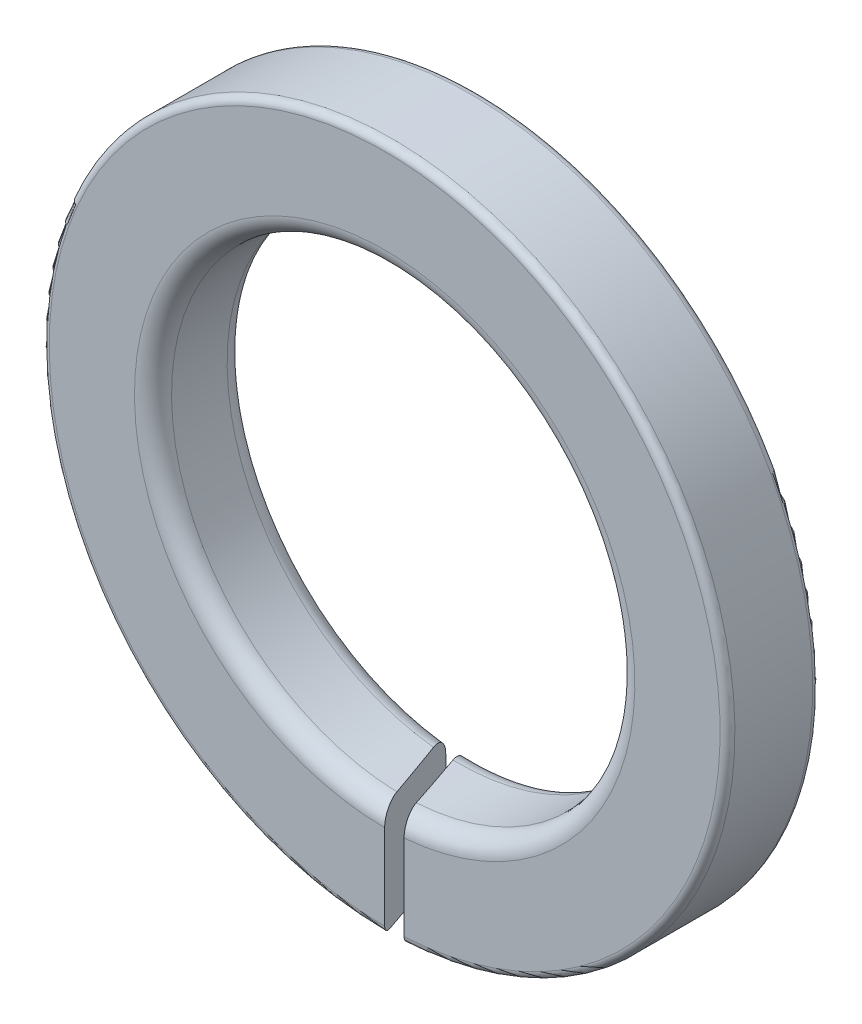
ISO-10303-21;
HEADER;
FILE_DESCRIPTION(('STEP AP214'),'2;1');
FILE_NAME('part.step','',(''),(''),'','','');
FILE_SCHEMA(('AUTOMOTIVE_DESIGN { 1 0 10303 214 1 1 1 1 }'));
ENDSEC;
DATA;
#1=APPLICATION_CONTEXT('core data for automotive mechanical design processes');
#2=APPLICATION_PROTOCOL_DEFINITION('international standard','automotive_design',2000,#1);
#3=PRODUCT_CONTEXT('',#1,'mechanical');
#4=PRODUCT('Part','Part','',(#3));
#5=PRODUCT_RELATED_PRODUCT_CATEGORY('part','',(#4));
#6=PRODUCT_DEFINITION_FORMATION('','',#4);
#7=PRODUCT_DEFINITION_CONTEXT('part definition',#1,'design');
#8=PRODUCT_DEFINITION('design','',#6,#7);
#9=PRODUCT_DEFINITION_SHAPE('','',#8);
#10=(LENGTH_UNIT() NAMED_UNIT(*) SI_UNIT(.MILLI.,.METRE.));
#11=(NAMED_UNIT(*) PLANE_ANGLE_UNIT() SI_UNIT($,.RADIAN.));
#12=(NAMED_UNIT(*) SI_UNIT($,.STERADIAN.) SOLID_ANGLE_UNIT());
#13=UNCERTAINTY_MEASURE_WITH_UNIT(LENGTH_MEASURE(1.E-05),#10,'distance_accuracy_value','');
#14=(GEOMETRIC_REPRESENTATION_CONTEXT(3) GLOBAL_UNCERTAINTY_ASSIGNED_CONTEXT((#13)) GLOBAL_UNIT_ASSIGNED_CONTEXT((#10,
#11,#12)) REPRESENTATION_CONTEXT('',''));
#15=CARTESIAN_POINT('',(0.,0.,0.));
#16=DIRECTION('',(0.,0.,1.));
#17=DIRECTION('',(1.,0.,0.));
#18=AXIS2_PLACEMENT_3D('',#15,#16,#17);
#19=CARTESIAN_POINT('',(0.,0.,2.5));
#20=DIRECTION('',(0.,0.,1.));
#21=DIRECTION('',(1.,0.,0.));
#22=AXIS2_PLACEMENT_3D('',#19,#20,#21);
#23=PLANE('',#22);
#24=DIRECTION('',(0.,1.,0.));
#25=VECTOR('',#24,1.);
#26=CARTESIAN_POINT('',(0.524617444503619,-9.25,2.5));
#27=LINE('',#26,#25);
#28=CARTESIAN_POINT('',(0.524617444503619,-9.03478148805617,2.5));
#29=VERTEX_POINT('',#28);
#30=CARTESIAN_POINT('',(0.524617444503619,-6.72958219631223,2.5));
#31=VERTEX_POINT('',#30);
#32=EDGE_CURVE('E107',#29,#31,#27,.T.);
#33=ORIENTED_EDGE('',*,*,#32,.F.);
#34=CARTESIAN_POINT('',(0.,0.,2.5));
#35=DIRECTION('',(0.,0.,1.));
#36=DIRECTION('',(1.,0.,0.));
#37=AXIS2_PLACEMENT_3D('',#34,#35,#36);
#38=CIRCLE('',#37,9.05);
#39=CARTESIAN_POINT('',(0.,-9.05,2.5));
#40=VERTEX_POINT('',#39);
#41=EDGE_CURVE('E166',#29,#40,#38,.T.);
#42=ORIENTED_EDGE('',*,*,#41,.T.);
#43=DIRECTION('',(0.,1.,0.));
#44=VECTOR('',#43,1.);
#45=CARTESIAN_POINT('',(0.,-9.25,2.5));
#46=LINE('',#45,#44);
#47=CARTESIAN_POINT('',(0.,-6.75,2.5));
#48=VERTEX_POINT('',#47);
#49=EDGE_CURVE('E198',#40,#48,#46,.T.);
#50=ORIENTED_EDGE('',*,*,#49,.T.);
#51=CARTESIAN_POINT('',(0.,0.,2.5));
#52=DIRECTION('',(0.,0.,1.));
#53=DIRECTION('',(1.,0.,0.));
#54=AXIS2_PLACEMENT_3D('',#51,#52,#53);
#55=CIRCLE('',#54,6.75);
#56=EDGE_CURVE('E196',#48,#31,#55,.F.);
#57=ORIENTED_EDGE('',*,*,#56,.T.);
#58=EDGE_LOOP('',(#33,#42,#50,#57));
#59=FACE_BOUND('',#58,.T.);
#60=ADVANCED_FACE('F36',(#59),#23,.T.);
#61=CARTESIAN_POINT('',(0.,0.,0.));
#62=DIRECTION('',(0.,0.,1.));
#63=DIRECTION('',(1.,0.,0.));
#64=AXIS2_PLACEMENT_3D('',#61,#62,#63);
#65=PLANE('',#64);
#66=DIRECTION('',(0.,1.,0.));
#67=VECTOR('',#66,1.);
#68=CARTESIAN_POINT('',(-0.851663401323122,-9.25,0.));
#69=LINE('',#68,#67);
#70=CARTESIAN_POINT('',(-0.851663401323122,-9.00983737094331,0.));
#71=VERTEX_POINT('',#70);
#72=CARTESIAN_POINT('',(-0.851663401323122,-6.69605626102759,0.));
#73=VERTEX_POINT('',#72);
#74=EDGE_CURVE('E226',#71,#73,#69,.T.);
#75=ORIENTED_EDGE('',*,*,#74,.F.);
#76=CARTESIAN_POINT('',(0.,0.,0.));
#77=DIRECTION('',(0.,0.,1.));
#78=DIRECTION('',(1.,0.,0.));
#79=AXIS2_PLACEMENT_3D('',#76,#77,#78);
#80=CIRCLE('',#79,9.05);
#81=CARTESIAN_POINT('',(-0.327045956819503,-9.04408872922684,0.));
#82=VERTEX_POINT('',#81);
#83=EDGE_CURVE('E11',#71,#82,#80,.F.);
#84=ORIENTED_EDGE('',*,*,#83,.T.);
#85=DIRECTION('',(0.,1.,0.));
#86=VECTOR('',#85,1.);
#87=CARTESIAN_POINT('',(-0.327045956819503,-9.25,0.));
#88=LINE('',#87,#86);
#89=CARTESIAN_POINT('',(-0.327045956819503,-6.74207245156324,0.));
#90=VERTEX_POINT('',#89);
#91=EDGE_CURVE('E197',#82,#90,#88,.T.);
#92=ORIENTED_EDGE('',*,*,#91,.T.);
#93=CARTESIAN_POINT('',(0.,0.,0.));
#94=DIRECTION('',(0.,0.,1.));
#95=DIRECTION('',(1.,0.,0.));
#96=AXIS2_PLACEMENT_3D('',#93,#94,#95);
#97=CIRCLE('',#96,6.75);
#98=EDGE_CURVE('E112',#90,#73,#97,.T.);
#99=ORIENTED_EDGE('',*,*,#98,.T.);
#100=EDGE_LOOP('',(#75,#84,#92,#99));
#101=FACE_BOUND('',#100,.T.);
#102=ADVANCED_FACE('F218',(#101),#65,.F.);
#103=CARTESIAN_POINT('',(0.,0.,2.5));
#104=DIRECTION('',(0.,0.,-1.));
#105=DIRECTION('',(-1.,0.,0.));
#106=AXIS2_PLACEMENT_3D('',#103,#104,#105);
#107=CYLINDRICAL_SURFACE('',#106,9.25);
#108=CARTESIAN_POINT('',(0.,0.,2.5));
#109=DIRECTION('',(-0.946580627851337,0.,0.322467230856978));
#110=DIRECTION('',(-0.322467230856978,0.,-0.946580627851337));
#111=AXIS2_PLACEMENT_3D('',#108,#109,#110);
#112=ELLIPSE('',#111,28.6850852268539,9.25);
#113=CARTESIAN_POINT('',(-0.783530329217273,-9.21675540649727,0.199999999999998));
#114=VERTEX_POINT('',#113);
#115=CARTESIAN_POINT('',(-0.0681330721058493,-9.24974907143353,2.3));
#116=VERTEX_POINT('',#115);
#117=EDGE_CURVE('E234',#114,#116,#112,.T.);
#118=ORIENTED_EDGE('',*,*,#117,.T.);
#119=CARTESIAN_POINT('',(0.,0.,2.3));
#120=DIRECTION('',(0.,0.,1.));
#121=DIRECTION('',(1.,0.,0.));
#122=AXIS2_PLACEMENT_3D('',#119,#120,#121);
#123=CIRCLE('',#122,9.25);
#124=CARTESIAN_POINT('',(0.45648437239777,-9.2387294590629,2.3));
#125=VERTEX_POINT('',#124);
#126=EDGE_CURVE('E184',#116,#125,#123,.F.);
#127=ORIENTED_EDGE('',*,*,#126,.T.);
#128=CARTESIAN_POINT('',(0.,0.,0.960021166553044));
#129=DIRECTION('',(0.946580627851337,0.,-0.322467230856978));
#130=DIRECTION('',(-0.322467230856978,0.,-0.946580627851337));
#131=AXIS2_PLACEMENT_3D('',#128,#129,#130);
#132=ELLIPSE('',#131,28.6850852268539,9.25);
#133=CARTESIAN_POINT('',(-0.258912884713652,-9.24637572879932,0.200000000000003));
#134=VERTEX_POINT('',#133);
#135=EDGE_CURVE('E189',#125,#134,#132,.T.);
#136=ORIENTED_EDGE('',*,*,#135,.T.);
#137=CARTESIAN_POINT('',(0.,0.,0.2));
#138=DIRECTION('',(0.,0.,1.));
#139=DIRECTION('',(1.,0.,0.));
#140=AXIS2_PLACEMENT_3D('',#137,#138,#139);
#141=CIRCLE('',#140,9.25);
#142=EDGE_CURVE('E231',#134,#114,#141,.T.);
#143=ORIENTED_EDGE('',*,*,#142,.T.);
#144=EDGE_LOOP('',(#118,#127,#136,#143));
#145=FACE_BOUND('',#144,.T.);
#146=ADVANCED_FACE('F38',(#145),#107,.T.);
#147=CARTESIAN_POINT('',(0.,0.,2.5));
#148=DIRECTION('',(0.,0.,-1.));
#149=DIRECTION('',(-1.,0.,0.));
#150=AXIS2_PLACEMENT_3D('',#147,#148,#149);
#151=CYLINDRICAL_SURFACE('',#150,6.25);
#152=CARTESIAN_POINT('',(0.,0.,0.960021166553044));
#153=DIRECTION('',(0.946580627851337,0.,-0.322467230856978));
#154=DIRECTION('',(-0.322467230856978,0.,-0.946580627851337));
#155=AXIS2_PLACEMENT_3D('',#152,#153,#154);
#156=ELLIPSE('',#155,19.3818143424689,6.25);
#157=CARTESIAN_POINT('',(0.354284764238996,-6.23995050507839,2.));
#158=VERTEX_POINT('',#157);
#159=CARTESIAN_POINT('',(-0.156713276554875,-6.24803496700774,0.50000000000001));
#160=VERTEX_POINT('',#159);
#161=EDGE_CURVE('E104',#158,#160,#156,.T.);
#162=ORIENTED_EDGE('',*,*,#161,.F.);
#163=CARTESIAN_POINT('',(0.,0.,2.));
#164=DIRECTION('',(0.,0.,1.));
#165=DIRECTION('',(1.,0.,0.));
#166=AXIS2_PLACEMENT_3D('',#163,#164,#165);
#167=CIRCLE('',#166,6.25);
#168=CARTESIAN_POINT('',(-0.170332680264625,-6.24767851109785,2.));
#169=VERTEX_POINT('',#168);
#170=EDGE_CURVE('E119',#158,#169,#167,.T.);
#171=ORIENTED_EDGE('',*,*,#170,.T.);
#172=CARTESIAN_POINT('',(0.,0.,2.5));
#173=DIRECTION('',(-0.946580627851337,0.,0.322467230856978));
#174=DIRECTION('',(-0.322467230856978,0.,-0.946580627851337));
#175=AXIS2_PLACEMENT_3D('',#172,#173,#174);
#176=ELLIPSE('',#175,19.3818143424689,6.25);
#177=CARTESIAN_POINT('',(-0.681330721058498,-6.21275208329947,0.499999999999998));
#178=VERTEX_POINT('',#177);
#179=EDGE_CURVE('E123',#178,#169,#176,.T.);
#180=ORIENTED_EDGE('',*,*,#179,.F.);
#181=CARTESIAN_POINT('',(0.,0.,0.5));
#182=DIRECTION('',(0.,0.,1.));
#183=DIRECTION('',(1.,0.,0.));
#184=AXIS2_PLACEMENT_3D('',#181,#182,#183);
#185=CIRCLE('',#184,6.25);
#186=EDGE_CURVE('E122',#178,#160,#185,.F.);
#187=ORIENTED_EDGE('',*,*,#186,.T.);
#188=EDGE_LOOP('',(#162,#171,#180,#187));
#189=FACE_BOUND('',#188,.T.);
#190=ADVANCED_FACE('F117',(#189),#151,.F.);
#191=CARTESIAN_POINT('',(-0.851663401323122,-9.25,0.));
#192=DIRECTION('',(-0.946580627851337,0.,0.322467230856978));
#193=DIRECTION('',(0.322467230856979,0.,0.946580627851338));
#194=AXIS2_PLACEMENT_3D('',#191,#192,#193);
#195=PLANE('',#194);
#196=ORIENTED_EDGE('',*,*,#49,.F.);
#197=CARTESIAN_POINT('',(0.,-9.05,2.5));
#198=CARTESIAN_POINT('',(3.84626203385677E-06,-9.06081658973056,2.50001129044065));
#199=CARTESIAN_POINT('',(-0.000298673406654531,-9.07162685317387,2.49912326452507));
#200=CARTESIAN_POINT('',(-0.00148666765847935,-9.09291094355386,2.4956359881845));
#201=CARTESIAN_POINT('',(-0.00237083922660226,-9.10338546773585,2.49304056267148));
#202=CARTESIAN_POINT('',(-0.00469255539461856,-9.12372487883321,2.48622532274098));
#203=CARTESIAN_POINT('',(-0.00613007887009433,-9.13358978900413,2.4820055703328));
#204=CARTESIAN_POINT('',(-0.00950739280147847,-9.15245493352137,2.47209169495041));
#205=CARTESIAN_POINT('',(-0.0114473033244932,-9.1614549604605,2.46639721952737));
#206=CARTESIAN_POINT('',(-0.0158147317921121,-9.17855935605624,2.45357693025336));
#207=CARTESIAN_POINT('',(-0.018252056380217,-9.18663960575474,2.44642232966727));
#208=CARTESIAN_POINT('',(-0.023511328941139,-9.20148943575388,2.43098409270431));
#209=CARTESIAN_POINT('',(-0.0263333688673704,-9.20825870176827,2.42270018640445));
#210=CARTESIAN_POINT('',(-0.0324292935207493,-9.2206479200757,2.40480601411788));
#211=CARTESIAN_POINT('',(-0.0357185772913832,-9.22619494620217,2.39515054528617));
#212=CARTESIAN_POINT('',(-0.0425410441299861,-9.23558765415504,2.37512365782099));
#213=CARTESIAN_POINT('',(-0.0460742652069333,-9.23943307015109,2.36475212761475));
#214=CARTESIAN_POINT('',(-0.0526903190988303,-9.24486127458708,2.3453311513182));
#215=CARTESIAN_POINT('',(-0.0557505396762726,-9.24671371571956,2.33634808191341));
#216=CARTESIAN_POINT('',(-0.0619182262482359,-9.24916921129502,2.31824325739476));
#217=CARTESIAN_POINT('',(-0.0650256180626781,-9.24977405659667,2.30912172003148));
#218=CARTESIAN_POINT('',(-0.0681330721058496,-9.24974907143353,2.3));
#219=B_SPLINE_CURVE_WITH_KNOTS('',3,(#197,#198,#199,#200,#201,#202,#203,#204,#205,#206,#207,
#208,#209,#210,#211,#212,#213,#214,#215,#216,#217,#218),.UNSPECIFIED.,.F.,.F.,(4,2,2,2,2,2,2,2,
2,2,4),(0.,0.0323994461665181,0.0647265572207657,0.0970524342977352,0.129386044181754,
0.162432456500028,0.195486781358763,0.230167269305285,0.264853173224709,0.293780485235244,
0.322666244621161),.UNSPECIFIED.);
#220=EDGE_CURVE('E165',#40,#116,#219,.T.);
#221=ORIENTED_EDGE('',*,*,#220,.T.);
#222=ORIENTED_EDGE('',*,*,#117,.F.);
#223=CARTESIAN_POINT('',(-0.783530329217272,-9.21675540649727,0.2));
#224=CARTESIAN_POINT('',(-0.787584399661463,-9.21641760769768,0.188099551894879));
#225=CARTESIAN_POINT('',(-0.791627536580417,-9.21499890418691,0.17623119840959));
#226=CARTESIAN_POINT('',(-0.799580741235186,-9.21008887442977,0.152885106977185));
#227=CARTESIAN_POINT('',(-0.80349081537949,-9.20659764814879,0.141407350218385));
#228=CARTESIAN_POINT('',(-0.811068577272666,-9.19762996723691,0.119163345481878));
#229=CARTESIAN_POINT('',(-0.814736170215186,-9.19215274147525,0.108397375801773));
#230=CARTESIAN_POINT('',(-0.821718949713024,-9.17935289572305,0.0878999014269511));
#231=CARTESIAN_POINT('',(-0.825034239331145,-9.17203081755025,0.0781680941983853));
#232=CARTESIAN_POINT('',(-0.831180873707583,-9.15579387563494,0.0601250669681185));
#233=CARTESIAN_POINT('',(-0.834016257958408,-9.14689374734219,0.0518019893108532));
#234=CARTESIAN_POINT('',(-0.839140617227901,-9.12768229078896,0.0367597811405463));
#235=CARTESIAN_POINT('',(-0.841429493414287,-9.11737070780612,0.0300409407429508));
#236=CARTESIAN_POINT('',(-0.845285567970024,-9.09609059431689,0.0187216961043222));
#237=CARTESIAN_POINT('',(-0.84687901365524,-9.08516777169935,0.0140442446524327));
#238=CARTESIAN_POINT('',(-0.849409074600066,-9.06262330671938,0.00661742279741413));
#239=CARTESIAN_POINT('',(-0.850346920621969,-9.05100301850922,0.00386443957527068));
#240=CARTESIAN_POINT('',(-0.85117609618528,-9.03436434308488,0.00143045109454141));
#241=CARTESIAN_POINT('',(-0.851358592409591,-9.02947279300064,0.000894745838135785));
#242=CARTESIAN_POINT('',(-0.85160213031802,-9.01966753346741,0.000179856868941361));
#243=CARTESIAN_POINT('',(-0.851663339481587,-9.01475386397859,1.81531620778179E-07));
#244=CARTESIAN_POINT('',(-0.851663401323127,-9.00983737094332,0.));
#245=B_SPLINE_CURVE_WITH_KNOTS('',3,(#223,#224,#225,#226,#227,#228,#229,#230,#231,#232,#233,
#234,#235,#236,#237,#238,#239,#240,#241,#242,#243,#244),.UNSPECIFIED.,.F.,.F.,(4,2,2,2,2,2,2,2,
2,2,4),(0.,0.0376783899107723,0.0753549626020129,0.113046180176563,0.150726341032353,
0.18807159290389,0.225423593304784,0.261208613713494,0.296926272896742,0.311686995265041,
0.326427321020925),.UNSPECIFIED.);
#246=EDGE_CURVE('E159',#114,#71,#245,.T.);
#247=ORIENTED_EDGE('',*,*,#246,.T.);
#248=ORIENTED_EDGE('',*,*,#74,.T.);
#249=CARTESIAN_POINT('',(-0.851663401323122,-6.69605626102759,0.));
#250=CARTESIAN_POINT('',(-0.851673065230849,-6.66948466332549,-2.83677439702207E-05));
#251=CARTESIAN_POINT('',(-0.850953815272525,-6.64291064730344,0.00208294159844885));
#252=CARTESIAN_POINT('',(-0.848097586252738,-6.59053101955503,0.0104672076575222));
#253=CARTESIAN_POINT('',(-0.845961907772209,-6.56472472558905,0.0167363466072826));
#254=CARTESIAN_POINT('',(-0.840310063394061,-6.51457807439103,0.0333269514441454));
#255=CARTESIAN_POINT('',(-0.836792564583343,-6.49023915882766,0.0436523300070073));
#256=CARTESIAN_POINT('',(-0.828486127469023,-6.44375769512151,0.0680353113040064));
#257=CARTESIAN_POINT('',(-0.823697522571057,-6.42161457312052,0.0820919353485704));
#258=CARTESIAN_POINT('',(-0.813015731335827,-6.38017613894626,0.113447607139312));
#259=CARTESIAN_POINT('',(-0.80712596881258,-6.360872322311,0.130736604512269));
#260=CARTESIAN_POINT('',(-0.794414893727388,-6.32548649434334,0.168049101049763));
#261=CARTESIAN_POINT('',(-0.78759342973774,-6.30940500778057,0.188073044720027));
#262=CARTESIAN_POINT('',(-0.772978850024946,-6.28030542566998,0.230973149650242));
#263=CARTESIAN_POINT('',(-0.765160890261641,-6.26740759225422,0.253922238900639));
#264=CARTESIAN_POINT('',(-0.748963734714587,-6.24559332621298,0.301467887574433));
#265=CARTESIAN_POINT('',(-0.740584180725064,-6.23667946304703,0.326065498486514));
#266=CARTESIAN_POINT('',(-0.723771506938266,-6.22316080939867,0.37541795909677));
#267=CARTESIAN_POINT('',(-0.715349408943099,-6.21842273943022,0.400140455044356));
#268=CARTESIAN_POINT('',(-0.698386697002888,-6.21274970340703,0.449933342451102));
#269=CARTESIAN_POINT('',(-0.689846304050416,-6.21180841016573,0.475003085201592));
#270=CARTESIAN_POINT('',(-0.681330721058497,-6.21275208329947,0.5));
#271=B_SPLINE_CURVE_WITH_KNOTS('',3,(#249,#250,#251,#252,#253,#254,#255,#256,#257,#258,#259,
#260,#261,#262,#263,#264,#265,#266,#267,#268,#269,#270),.UNSPECIFIED.,.F.,.F.,(4,2,2,2,2,2,2,2,
2,2,4),(0.,0.0796240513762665,0.159175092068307,0.238803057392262,0.318410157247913,
0.397773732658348,0.477150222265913,0.559177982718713,0.641258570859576,0.720613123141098,
0.799835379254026),.UNSPECIFIED.);
#272=EDGE_CURVE('E128',#73,#178,#271,.T.);
#273=ORIENTED_EDGE('',*,*,#272,.T.);
#274=ORIENTED_EDGE('',*,*,#179,.T.);
#275=CARTESIAN_POINT('',(-0.170332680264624,-6.24767851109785,2.));
#276=CARTESIAN_POINT('',(-0.160218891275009,-6.24793898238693,2.02968833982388));
#277=CARTESIAN_POINT('',(-0.150112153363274,-6.25084969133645,2.05935598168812));
#278=CARTESIAN_POINT('',(-0.130183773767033,-6.26183826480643,2.11785438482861));
#279=CARTESIAN_POINT('',(-0.120362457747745,-6.26992180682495,2.14668419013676));
#280=CARTESIAN_POINT('',(-0.101289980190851,-6.29113201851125,2.20267015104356));
#281=CARTESIAN_POINT('',(-0.0920393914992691,-6.30426366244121,2.22982462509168));
#282=CARTESIAN_POINT('',(-0.0744143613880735,-6.33528941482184,2.28156170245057));
#283=CARTESIAN_POINT('',(-0.0660393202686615,-6.3531802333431,2.30614606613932));
#284=CARTESIAN_POINT('',(-0.0506800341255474,-6.3927240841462,2.35123220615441));
#285=CARTESIAN_POINT('',(-0.0436622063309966,-6.41425140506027,2.37183256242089));
#286=CARTESIAN_POINT('',(-0.0309800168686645,-6.46086721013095,2.40906026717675));
#287=CARTESIAN_POINT('',(-0.0253156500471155,-6.48595568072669,2.42568763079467));
#288=CARTESIAN_POINT('',(-0.0158665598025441,-6.53736150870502,2.45342479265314));
#289=CARTESIAN_POINT('',(-0.0119900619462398,-6.5635169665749,2.46480398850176));
#290=CARTESIAN_POINT('',(-0.00580110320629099,-6.61753201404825,2.48297125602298));
#291=CARTESIAN_POINT('',(-0.00348622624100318,-6.64538889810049,2.48976641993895));
#292=CARTESIAN_POINT('',(-0.00133323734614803,-6.68626120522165,2.49608637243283));
#293=CARTESIAN_POINT('',(-0.000833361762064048,-6.69896946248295,2.4975537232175));
#294=CARTESIAN_POINT('',(-0.000167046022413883,-6.72444959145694,2.49950964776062));
#295=CARTESIAN_POINT('',(-8.14869887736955E-08,-6.73722133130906,2.49999976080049));
#296=CARTESIAN_POINT('',(0.,-6.75,2.50000000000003));
#297=B_SPLINE_CURVE_WITH_KNOTS('',3,(#275,#276,#277,#278,#279,#280,#281,#282,#283,#284,#285,
#286,#287,#288,#289,#290,#291,#292,#293,#294,#295,#296),.UNSPECIFIED.,.F.,.F.,(4,2,2,2,2,2,2,2,
2,2,4),(0.,0.0939885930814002,0.188080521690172,0.282265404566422,0.376385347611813,
0.467745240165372,0.559104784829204,0.645029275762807,0.730820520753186,0.769192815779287,
0.807504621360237),.UNSPECIFIED.);
#298=EDGE_CURVE('E127',#169,#48,#297,.T.);
#299=ORIENTED_EDGE('',*,*,#298,.T.);
#300=EDGE_LOOP('',(#196,#221,#222,#247,#248,#273,#274,#299));
#301=FACE_BOUND('',#300,.T.);
#302=ADVANCED_FACE('F146',(#301),#195,.F.);
#303=CARTESIAN_POINT('',(0.524617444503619,-9.25,2.5));
#304=DIRECTION('',(0.946580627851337,0.,-0.322467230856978));
#305=DIRECTION('',(-0.322467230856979,0.,-0.946580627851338));
#306=AXIS2_PLACEMENT_3D('',#303,#304,#305);
#307=PLANE('',#306);
#308=ORIENTED_EDGE('',*,*,#135,.F.);
#309=CARTESIAN_POINT('',(0.456484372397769,-9.2387294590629,2.3));
#310=CARTESIAN_POINT('',(0.460513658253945,-9.23853743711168,2.3118276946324));
#311=CARTESIAN_POINT('',(0.464536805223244,-9.23727889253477,2.32363736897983));
#312=CARTESIAN_POINT('',(0.472460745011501,-9.23270096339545,2.34689755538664));
#313=CARTESIAN_POINT('',(0.476361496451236,-9.22938088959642,2.35834794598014));
#314=CARTESIAN_POINT('',(0.483930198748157,-9.22074951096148,2.38056535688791));
#315=CARTESIAN_POINT('',(0.487597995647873,-9.21543690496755,2.39133192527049));
#316=CARTESIAN_POINT('',(0.494586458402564,-9.20294935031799,2.41184608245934));
#317=CARTESIAN_POINT('',(0.497907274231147,-9.19577521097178,2.42159411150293));
#318=CARTESIAN_POINT('',(0.504043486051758,-9.17987153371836,2.43960654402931));
#319=CARTESIAN_POINT('',(0.506866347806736,-9.1711697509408,2.44789286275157));
#320=CARTESIAN_POINT('',(0.511974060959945,-9.15235295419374,2.46288620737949));
#321=CARTESIAN_POINT('',(0.514258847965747,-9.14223777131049,2.46959304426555));
#322=CARTESIAN_POINT('',(0.5181067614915,-9.12138520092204,2.48088833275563));
#323=CARTESIAN_POINT('',(0.519698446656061,-9.11069843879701,2.48556061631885));
#324=CARTESIAN_POINT('',(0.522241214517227,-9.08862410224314,2.49302473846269));
#325=CARTESIAN_POINT('',(0.523193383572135,-9.07723775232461,2.49581976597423));
#326=CARTESIAN_POINT('',(0.52407442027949,-9.0605801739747,2.49840598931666));
#327=CARTESIAN_POINT('',(0.5242778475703,-9.05543712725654,2.49900313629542));
#328=CARTESIAN_POINT('',(0.524549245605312,-9.04512417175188,2.49979980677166));
#329=CARTESIAN_POINT('',(0.524617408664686,-9.03995431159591,2.49999989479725));
#330=CARTESIAN_POINT('',(0.524617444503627,-9.03478148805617,2.50000000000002));
#331=B_SPLINE_CURVE_WITH_KNOTS('',3,(#309,#310,#311,#312,#313,#314,#315,#316,#317,#318,#319,
#320,#321,#322,#323,#324,#325,#326,#327,#328,#329,#330),.UNSPECIFIED.,.F.,.F.,(4,2,2,2,2,2,2,2,
2,2,4),(0.,0.0374428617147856,0.0748982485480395,0.112378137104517,0.149841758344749,
0.186684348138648,0.223531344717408,0.258669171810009,0.293747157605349,0.309277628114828,
0.324786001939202),.UNSPECIFIED.);
#332=EDGE_CURVE('E44',#125,#29,#331,.T.);
#333=ORIENTED_EDGE('',*,*,#332,.T.);
#334=ORIENTED_EDGE('',*,*,#32,.T.);
#335=CARTESIAN_POINT('',(0.524617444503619,-6.72958219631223,2.5));
#336=CARTESIAN_POINT('',(0.524627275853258,-6.70290996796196,2.50002885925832));
#337=CARTESIAN_POINT('',(0.523895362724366,-6.67624247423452,2.49788037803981));
#338=CARTESIAN_POINT('',(0.521001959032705,-6.62370529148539,2.48938698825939));
#339=CARTESIAN_POINT('',(0.518842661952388,-6.59783444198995,2.48304851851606));
#340=CARTESIAN_POINT('',(0.513146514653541,-6.54757842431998,2.46632786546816));
#341=CARTESIAN_POINT('',(0.509608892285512,-6.52319409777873,2.45594341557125));
#342=CARTESIAN_POINT('',(0.501273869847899,-6.47659941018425,2.43147652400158));
#343=CARTESIAN_POINT('',(0.496476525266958,-6.45438895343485,2.41739424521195));
#344=CARTESIAN_POINT('',(0.48573454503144,-6.41254263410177,2.38586189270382));
#345=CARTESIAN_POINT('',(0.479781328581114,-6.3929279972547,2.3683866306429));
#346=CARTESIAN_POINT('',(0.466937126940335,-6.35691856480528,2.33068335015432));
#347=CARTESIAN_POINT('',(0.460045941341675,-6.34052445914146,2.31045474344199));
#348=CARTESIAN_POINT('',(0.445205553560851,-6.31062929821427,2.26689179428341));
#349=CARTESIAN_POINT('',(0.437223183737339,-6.29728685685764,2.24346009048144));
#350=CARTESIAN_POINT('',(0.420677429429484,-6.27467215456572,2.19489115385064));
#351=CARTESIAN_POINT('',(0.41211377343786,-6.26540181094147,2.16975312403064));
#352=CARTESIAN_POINT('',(0.395374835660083,-6.2516622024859,2.12061711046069));
#353=CARTESIAN_POINT('',(0.387228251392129,-6.24685231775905,2.09670336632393));
#354=CARTESIAN_POINT('',(0.370812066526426,-6.24076137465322,2.04851477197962));
#355=CARTESIAN_POINT('',(0.362542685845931,-6.23947462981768,2.02424056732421));
#356=CARTESIAN_POINT('',(0.354284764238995,-6.2399505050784,2.));
#357=B_SPLINE_CURVE_WITH_KNOTS('',3,(#335,#336,#337,#338,#339,#340,#341,#342,#343,#344,#345,
#346,#347,#348,#349,#350,#351,#352,#353,#354,#355,#356),.UNSPECIFIED.,.F.,.F.,(4,2,2,2,2,2,2,2,
2,2,4),(0.,0.0799122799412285,0.15970204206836,0.239536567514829,0.319367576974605,
0.399815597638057,0.480280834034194,0.564278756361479,0.648316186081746,0.725223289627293,
0.802006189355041),.UNSPECIFIED.);
#358=EDGE_CURVE('E100',#31,#158,#357,.T.);
#359=ORIENTED_EDGE('',*,*,#358,.T.);
#360=ORIENTED_EDGE('',*,*,#161,.T.);
#361=CARTESIAN_POINT('',(-0.156713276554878,-6.24803496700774,0.5));
#362=CARTESIAN_POINT('',(-0.166704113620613,-6.24776788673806,0.470672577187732));
#363=CARTESIAN_POINT('',(-0.176704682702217,-6.25009024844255,0.441316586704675));
#364=CARTESIAN_POINT('',(-0.196459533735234,-6.25984023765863,0.383327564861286));
#365=CARTESIAN_POINT('',(-0.206213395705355,-6.26727603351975,0.354695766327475));
#366=CARTESIAN_POINT('',(-0.225188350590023,-6.28719333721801,0.298996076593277));
#367=CARTESIAN_POINT('',(-0.234408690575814,-6.29968178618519,0.27193039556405));
#368=CARTESIAN_POINT('',(-0.251997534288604,-6.32946218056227,0.220299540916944));
#369=CARTESIAN_POINT('',(-0.260366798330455,-6.3467497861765,0.195732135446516));
#370=CARTESIAN_POINT('',(-0.275658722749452,-6.38497855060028,0.150843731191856));
#371=CARTESIAN_POINT('',(-0.28262489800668,-6.40575201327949,0.130394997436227));
#372=CARTESIAN_POINT('',(-0.295244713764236,-6.45084817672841,0.0933503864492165));
#373=CARTESIAN_POINT('',(-0.300898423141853,-6.47517069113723,0.0767543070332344));
#374=CARTESIAN_POINT('',(-0.310366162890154,-6.52504725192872,0.0489624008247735));
#375=CARTESIAN_POINT('',(-0.314271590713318,-6.55043488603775,0.0374982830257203));
#376=CARTESIAN_POINT('',(-0.320578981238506,-6.60293313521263,0.0189833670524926));
#377=CARTESIAN_POINT('',(-0.322982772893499,-6.63004160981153,0.0119272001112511));
#378=CARTESIAN_POINT('',(-0.325411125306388,-6.67151470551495,0.00479893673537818));
#379=CARTESIAN_POINT('',(-0.326024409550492,-6.68557040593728,0.00299868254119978));
#380=CARTESIAN_POINT('',(-0.32684154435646,-6.71377260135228,0.000600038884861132));
#381=CARTESIAN_POINT('',(-0.327046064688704,-6.7279189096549,-3.1664270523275E-07));
#382=CARTESIAN_POINT('',(-0.327045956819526,-6.74207245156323,0.));
#383=B_SPLINE_CURVE_WITH_KNOTS('',3,(#361,#362,#363,#364,#365,#366,#367,#368,#369,#370,#371,
#372,#373,#374,#375,#376,#377,#378,#379,#380,#381,#382),.UNSPECIFIED.,.F.,.F.,(4,2,2,2,2,2,2,2,
2,2,4),(0.,0.0928601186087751,0.185868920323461,0.279005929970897,0.372058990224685,
0.461503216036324,0.550942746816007,0.634909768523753,0.718774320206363,0.761275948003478,
0.803707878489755),.UNSPECIFIED.);
#384=EDGE_CURVE('E113',#160,#90,#383,.T.);
#385=ORIENTED_EDGE('',*,*,#384,.T.);
#386=ORIENTED_EDGE('',*,*,#91,.F.);
#387=CARTESIAN_POINT('',(-0.327045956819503,-9.04408872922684,0.));
#388=CARTESIAN_POINT('',(-0.327049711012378,-9.05501092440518,-1.10201778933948E-05));
#389=CARTESIAN_POINT('',(-0.326741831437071,-9.0659247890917,0.000892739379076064));
#390=CARTESIAN_POINT('',(-0.325536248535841,-9.087407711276,0.00443164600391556));
#391=CARTESIAN_POINT('',(-0.324640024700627,-9.09797756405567,0.00706245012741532));
#392=CARTESIAN_POINT('',(-0.322291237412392,-9.11849903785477,0.0139571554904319));
#393=CARTESIAN_POINT('',(-0.320838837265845,-9.12845083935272,0.0182205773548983));
#394=CARTESIAN_POINT('',(-0.317430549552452,-9.1474887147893,0.0282253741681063));
#395=CARTESIAN_POINT('',(-0.315474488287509,-9.15657448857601,0.0339672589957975));
#396=CARTESIAN_POINT('',(-0.311059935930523,-9.17390763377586,0.0469258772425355));
#397=CARTESIAN_POINT('',(-0.308588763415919,-9.18212390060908,0.054179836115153));
#398=CARTESIAN_POINT('',(-0.303256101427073,-9.19723128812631,0.069833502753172));
#399=CARTESIAN_POINT('',(-0.300394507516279,-9.20412205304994,0.0782335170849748));
#400=CARTESIAN_POINT('',(-0.294204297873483,-9.21675685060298,0.09640445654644));
#401=CARTESIAN_POINT('',(-0.290859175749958,-9.22242306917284,0.106223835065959));
#402=CARTESIAN_POINT('',(-0.283918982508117,-9.23201621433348,0.126596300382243));
#403=CARTESIAN_POINT('',(-0.280323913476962,-9.23594315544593,0.137149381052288));
#404=CARTESIAN_POINT('',(-0.273758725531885,-9.24133929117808,0.156421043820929));
#405=CARTESIAN_POINT('',(-0.270817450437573,-9.24315282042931,0.165054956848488));
#406=CARTESIAN_POINT('',(-0.26488922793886,-9.24562912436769,0.182456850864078));
#407=CARTESIAN_POINT('',(-0.26190235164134,-9.24629353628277,0.191224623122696));
#408=CARTESIAN_POINT('',(-0.258912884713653,-9.24637572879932,0.2));
#409=B_SPLINE_CURVE_WITH_KNOTS('',3,(#387,#388,#389,#390,#391,#392,#393,#394,#395,#396,#397,
#398,#399,#400,#401,#402,#403,#404,#405,#406,#407,#408),.UNSPECIFIED.,.F.,.F.,(4,2,2,2,2,2,2,2,
2,2,4),(0.,0.0327123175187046,0.0653426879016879,0.0979634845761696,0.130595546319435,
0.164153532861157,0.197720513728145,0.233024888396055,0.268328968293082,0.296158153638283,
0.323947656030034),.UNSPECIFIED.);
#410=EDGE_CURVE('E56',#82,#134,#409,.T.);
#411=ORIENTED_EDGE('',*,*,#410,.T.);
#412=EDGE_LOOP('',(#308,#333,#334,#359,#360,#385,#386,#411));
#413=FACE_BOUND('',#412,.T.);
#414=ADVANCED_FACE('F102',(#413),#307,.F.);
#415=CARTESIAN_POINT('',(0.,0.,2.));
#416=DIRECTION('',(0.,0.,1.));
#417=DIRECTION('',(1.,0.,0.));
#418=AXIS2_PLACEMENT_3D('',#415,#416,#417);
#419=TOROIDAL_SURFACE('',#418,6.75,0.5);
#420=ORIENTED_EDGE('',*,*,#358,.F.);
#421=ORIENTED_EDGE('',*,*,#56,.F.);
#422=ORIENTED_EDGE('',*,*,#298,.F.);
#423=ORIENTED_EDGE('',*,*,#170,.F.);
#424=EDGE_LOOP('',(#420,#421,#422,#423));
#425=FACE_BOUND('',#424,.T.);
#426=ADVANCED_FACE('F125',(#425),#419,.T.);
#427=CARTESIAN_POINT('',(0.,0.,0.5));
#428=DIRECTION('',(0.,0.,1.));
#429=DIRECTION('',(1.,0.,0.));
#430=AXIS2_PLACEMENT_3D('',#427,#428,#429);
#431=TOROIDAL_SURFACE('',#430,6.75,0.5);
#432=ORIENTED_EDGE('',*,*,#384,.F.);
#433=ORIENTED_EDGE('',*,*,#186,.F.);
#434=ORIENTED_EDGE('',*,*,#272,.F.);
#435=ORIENTED_EDGE('',*,*,#98,.F.);
#436=EDGE_LOOP('',(#432,#433,#434,#435));
#437=FACE_BOUND('',#436,.T.);
#438=ADVANCED_FACE('F143',(#437),#431,.T.);
#439=CARTESIAN_POINT('',(0.,0.,2.3));
#440=DIRECTION('',(0.,0.,1.));
#441=DIRECTION('',(1.,0.,0.));
#442=AXIS2_PLACEMENT_3D('',#439,#440,#441);
#443=TOROIDAL_SURFACE('',#442,9.05,0.2);
#444=ORIENTED_EDGE('',*,*,#332,.F.);
#445=ORIENTED_EDGE('',*,*,#126,.F.);
#446=ORIENTED_EDGE('',*,*,#220,.F.);
#447=ORIENTED_EDGE('',*,*,#41,.F.);
#448=EDGE_LOOP('',(#444,#445,#446,#447));
#449=FACE_BOUND('',#448,.T.);
#450=ADVANCED_FACE('F175',(#449),#443,.T.);
#451=CARTESIAN_POINT('',(0.,0.,0.2));
#452=DIRECTION('',(0.,0.,1.));
#453=DIRECTION('',(1.,0.,0.));
#454=AXIS2_PLACEMENT_3D('',#451,#452,#453);
#455=TOROIDAL_SURFACE('',#454,9.05,0.2);
#456=ORIENTED_EDGE('',*,*,#410,.F.);
#457=ORIENTED_EDGE('',*,*,#83,.F.);
#458=ORIENTED_EDGE('',*,*,#246,.F.);
#459=ORIENTED_EDGE('',*,*,#142,.F.);
#460=EDGE_LOOP('',(#456,#457,#458,#459));
#461=FACE_BOUND('',#460,.T.);
#462=ADVANCED_FACE('F172',(#461),#455,.T.);
#463=CLOSED_SHELL('',(#60,#102,#146,#190,#302,#414,#426,#438,#450,#462));
#464=MANIFOLD_SOLID_BREP('B2',#463);
#465=ADVANCED_BREP_SHAPE_REPRESENTATION('',(#18,#464),#14);
#466=SHAPE_DEFINITION_REPRESENTATION(#9,#465);
ENDSEC;
END-ISO-10303-21;
